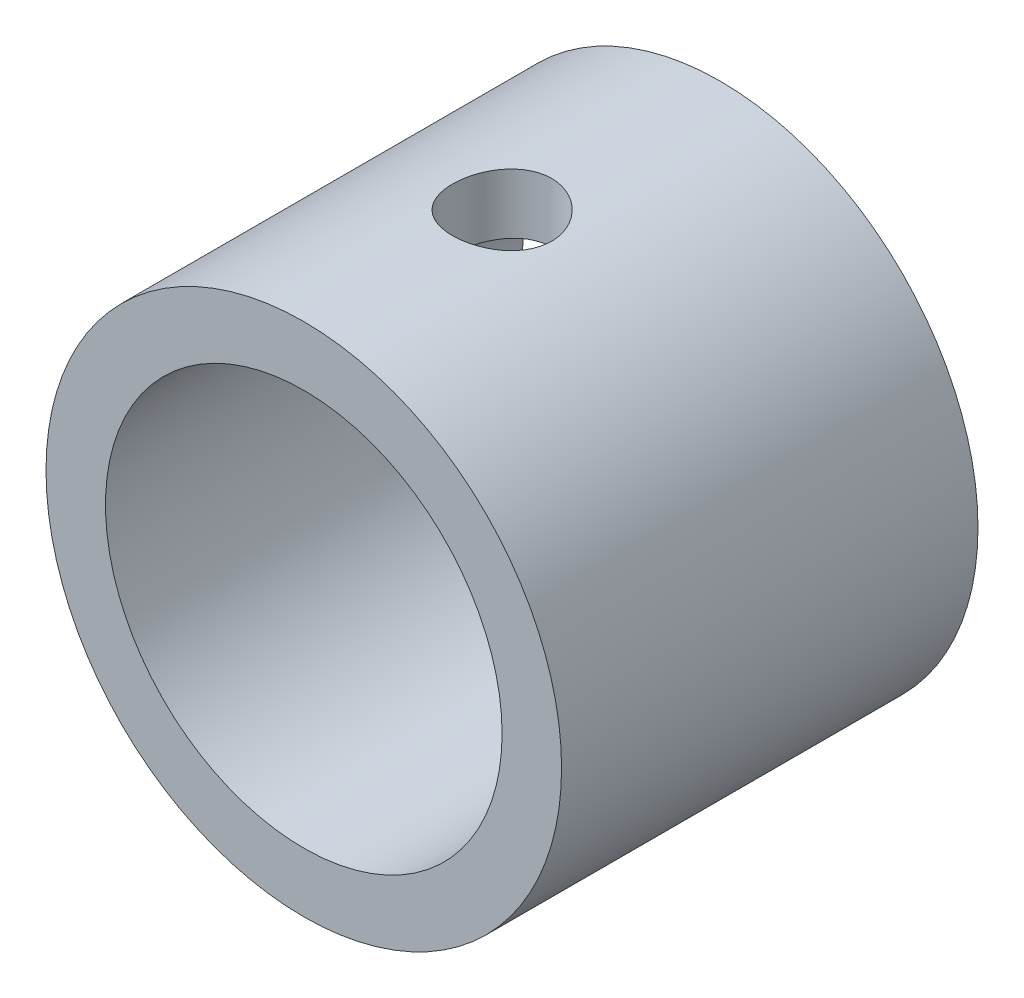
from build123d import *

# Parameters (mm, degrees)
ESQUISSE1_R      = 13
ESQUISSE1_R_2    = 10
EXTRUSION1_DEPTH = 21
ESQUISSE2_W      = 2.5
ESQUISSE2_H      = 13


with BuildPart() as part:
    # Esquisse1 → Extrusion1 (new body)
    with BuildSketch(Plane.XY):
        with Locations(Location((0, 0, 0), (0, 0, 180))):
            Circle(ESQUISSE1_R)
        with Locations(Location((0, 0, 0), (0, 0, 180))):
            Circle(ESQUISSE1_R_2, mode=Mode.SUBTRACT)
    extrude(amount=EXTRUSION1_DEPTH)

    # Esquisse2 → Trou taraud_ M61 (revolve, cut)
    with BuildSketch(Plane(origin=(0, 0, 11), x_dir=(0, 0, -1), z_dir=(1, 0, 0))):
        with Locations((1.25, 6.5)):
            Rectangle(ESQUISSE2_W, ESQUISSE2_H)
    revolve(axis=Axis((0, -6.35, 11), (0, 1, 0)), mode=Mode.SUBTRACT)


solid = part.part
